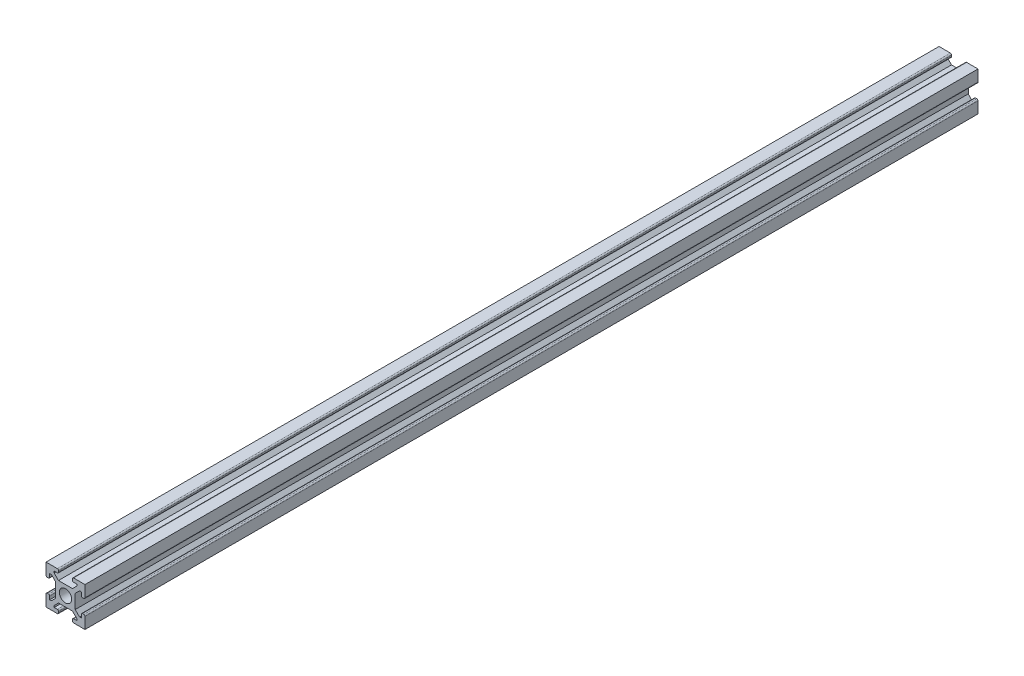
from build123d import *

# Parameters (mm, degrees)
SKETCH1_W           = 20.066
SKETCH1_H           = 20.066
SKETCH1_R           = 6.35
BOSS_EXTRUDE1_DEPTH = 919.736032
FILLET1_R           = 1.27


with BuildPart() as part:
    # Sketch1 → Boss-Extrude1 (new body)
    # profile 1 of 5: a face of its own
    with BuildSketch(Plane.XY):
        Polygon((-17.005531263, 26.594140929), (-17.005531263, 30.404140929), (-29.967318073, 30.404140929), (-29.967318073, 17.442354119), (-26.157318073, 17.442354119), (-26.157318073, 22.014354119), (-24.379318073, 22.014354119), (-19.934318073, 17.569354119), (-19.934318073, 20.371140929), (-17.132531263, 20.371140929), (-21.577531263, 24.816140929), (-21.577531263, 26.594140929), align=None)
    # profile 2 of 5: a face of its own
    with BuildSketch(Plane.XY):
        with Locations((-9.901318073, 10.338140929)):
            Rectangle(SKETCH1_W, SKETCH1_H)
        with Locations(Location((-9.901318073, 10.338140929, 0), (0, 0, 180))):
            Circle(SKETCH1_R, mode=Mode.SUBTRACT)
    # profile 3 of 5: a face of its own
    with BuildSketch(Plane.XY):
        Polygon((10.164681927, 30.404140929), (-2.797104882, 30.404140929), (-2.797104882, 26.594140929), (1.774895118, 26.594140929), (1.774895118, 24.816140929), (-2.670104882, 20.371140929), (0.131681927, 20.371140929), (0.131681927, 17.569354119), (4.576681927, 22.014354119), (6.354681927, 22.014354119), (6.354681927, 17.442354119), (10.164681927, 17.442354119), align=None)
    # profile 4 of 5: a face of its own
    with BuildSketch(Plane.XY):
        Polygon((10.164681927, -9.727859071), (10.164681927, 3.233927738), (6.354681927, 3.233927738), (6.354681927, -1.338072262), (4.576681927, -1.338072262), (0.131681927, 3.106927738), (0.131681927, 0.305140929), (-2.670104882, 0.305140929), (1.774895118, -4.139859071), (1.774895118, -5.917859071), (-2.797104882, -5.917859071), (-2.797104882, -9.727859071), align=None)
    # profile 5 of 5: a face of its own
    with BuildSketch(Plane.XY):
        Polygon((-26.157318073, 3.233927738), (-29.967318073, 3.233927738), (-29.967318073, -9.727859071), (-17.005531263, -9.727859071), (-17.005531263, -5.917859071), (-21.577531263, -5.917859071), (-21.577531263, -4.139859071), (-17.132531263, 0.305140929), (-19.934318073, 0.305140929), (-19.934318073, 3.106927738), (-24.379318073, -1.338072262), (-26.157318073, -1.338072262), align=None)
    extrude(amount=BOSS_EXTRUDE1_DEPTH)

    # Fillet1
    fillet1_edges = [part.edges().sort_by_distance(p)[0] for p in [
        (6.354681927, 3.233927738, 459.868016),
        (10.164681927, 3.233927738, 459.868016),
        (-2.797104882, -9.727859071, 459.868016),
        (-2.797104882, -5.917859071, 459.868016),
        (-17.005531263, -5.917859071, 459.868016),
        (-17.005531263, -9.727859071, 459.868016),
        (-29.967318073, 3.233927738, 459.868016),
        (-26.157318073, 3.233927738, 459.868016),
        (-26.157318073, 17.442354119, 459.868016),
        (-29.967318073, 17.442354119, 459.868016),
        (-17.005531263, 30.404140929, 459.868016),
        (-17.005531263, 26.594140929, 459.868016),
        (-2.797104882, 26.594140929, 459.868016),
        (-2.797104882, 30.404140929, 459.868016),
        (10.164681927, 17.442354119, 459.868016),
        (6.354681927, 17.442354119, 459.868016),
    ]]
    fillet(fillet1_edges, radius=FILLET1_R)


solid = part.part
